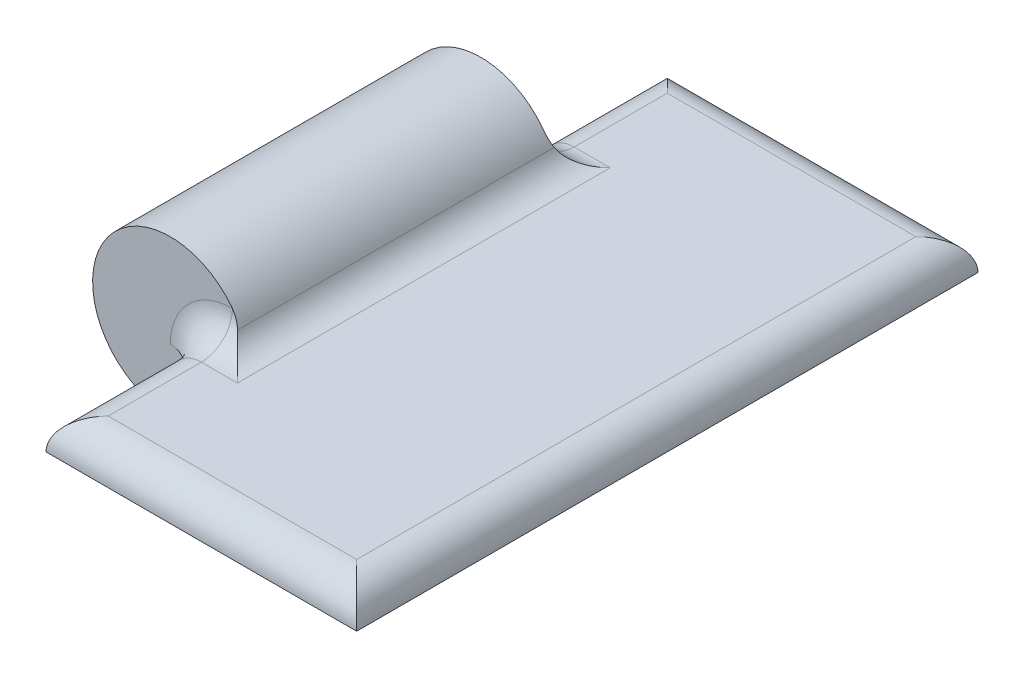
ISO-10303-21;
HEADER;
FILE_DESCRIPTION(('STEP AP214'),'2;1');
FILE_NAME('part.step','',(''),(''),'','','');
FILE_SCHEMA(('AUTOMOTIVE_DESIGN { 1 0 10303 214 1 1 1 1 }'));
ENDSEC;
DATA;
#1=APPLICATION_CONTEXT('core data for automotive mechanical design processes');
#2=APPLICATION_PROTOCOL_DEFINITION('international standard','automotive_design',2000,#1);
#3=PRODUCT_CONTEXT('',#1,'mechanical');
#4=PRODUCT('Part','Part','',(#3));
#5=PRODUCT_RELATED_PRODUCT_CATEGORY('part','',(#4));
#6=PRODUCT_DEFINITION_FORMATION('','',#4);
#7=PRODUCT_DEFINITION_CONTEXT('part definition',#1,'design');
#8=PRODUCT_DEFINITION('design','',#6,#7);
#9=PRODUCT_DEFINITION_SHAPE('','',#8);
#10=(LENGTH_UNIT() NAMED_UNIT(*) SI_UNIT(.MILLI.,.METRE.));
#11=(NAMED_UNIT(*) PLANE_ANGLE_UNIT() SI_UNIT($,.RADIAN.));
#12=(NAMED_UNIT(*) SI_UNIT($,.STERADIAN.) SOLID_ANGLE_UNIT());
#13=UNCERTAINTY_MEASURE_WITH_UNIT(LENGTH_MEASURE(1.E-05),#10,'distance_accuracy_value','');
#14=(GEOMETRIC_REPRESENTATION_CONTEXT(3) GLOBAL_UNCERTAINTY_ASSIGNED_CONTEXT((#13)) GLOBAL_UNIT_ASSIGNED_CONTEXT((#10,
#11,#12)) REPRESENTATION_CONTEXT('',''));
#15=CARTESIAN_POINT('',(0.,0.,0.));
#16=DIRECTION('',(0.,0.,1.));
#17=DIRECTION('',(1.,0.,0.));
#18=AXIS2_PLACEMENT_3D('',#15,#16,#17);
#19=CARTESIAN_POINT('',(0.,0.,20.));
#20=DIRECTION('',(0.,0.,1.));
#21=DIRECTION('',(1.,0.,0.));
#22=AXIS2_PLACEMENT_3D('',#19,#20,#21);
#23=PLANE('',#22);
#24=CARTESIAN_POINT('',(4.,-1.,20.));
#25=DIRECTION('',(0.,0.,1.));
#26=DIRECTION('',(1.,0.,0.));
#27=AXIS2_PLACEMENT_3D('',#24,#25,#26);
#28=CIRCLE('',#27,4.);
#29=CARTESIAN_POINT('',(4.,3.,20.));
#30=VERTEX_POINT('',#29);
#31=CARTESIAN_POINT('',(0.,-1.,20.));
#32=VERTEX_POINT('',#31);
#33=EDGE_CURVE('E193',#30,#32,#28,.T.);
#34=ORIENTED_EDGE('',*,*,#33,.F.);
#35=CARTESIAN_POINT('',(0.,0.,20.));
#36=DIRECTION('',(0.,0.,1.));
#37=DIRECTION('',(1.,0.,0.));
#38=AXIS2_PLACEMENT_3D('',#35,#36,#37);
#39=CIRCLE('',#38,5.);
#40=CARTESIAN_POINT('',(4.89897948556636,-1.,20.));
#41=VERTEX_POINT('',#40);
#42=EDGE_CURVE('E184',#30,#41,#39,.T.);
#43=ORIENTED_EDGE('',*,*,#42,.T.);
#44=DIRECTION('',(1.,0.,0.));
#45=VECTOR('',#44,1.);
#46=CARTESIAN_POINT('',(0.,-1.,20.));
#47=LINE('',#46,#45);
#48=EDGE_CURVE('E180',#32,#41,#47,.T.);
#49=ORIENTED_EDGE('',*,*,#48,.F.);
#50=EDGE_LOOP('',(#34,#43,#49));
#51=FACE_BOUND('',#50,.T.);
#52=ADVANCED_FACE('F33',(#51),#23,.T.);
#53=CARTESIAN_POINT('',(0.,1.,0.));
#54=DIRECTION('',(0.,-1.,0.));
#55=DIRECTION('',(0.,0.,-1.));
#56=AXIS2_PLACEMENT_3D('',#53,#54,#55);
#57=PLANE('',#56);
#58=DIRECTION('',(1.,0.,0.));
#59=VECTOR('',#58,1.);
#60=CARTESIAN_POINT('',(4.89897948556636,1.,-2.));
#61=LINE('',#60,#59);
#62=CARTESIAN_POINT('',(4.,1.,-2.));
#63=VERTEX_POINT('',#62);
#64=CARTESIAN_POINT('',(6.32455532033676,1.,-2.));
#65=VERTEX_POINT('',#64);
#66=EDGE_CURVE('E205',#63,#65,#61,.T.);
#67=ORIENTED_EDGE('',*,*,#66,.T.);
#68=DIRECTION('',(0.,0.,1.));
#69=VECTOR('',#68,1.);
#70=CARTESIAN_POINT('',(6.32455532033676,1.,20.));
#71=LINE('',#70,#69);
#72=CARTESIAN_POINT('',(6.32455532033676,1.,22.));
#73=VERTEX_POINT('',#72);
#74=EDGE_CURVE('E207',#65,#73,#71,.T.);
#75=ORIENTED_EDGE('',*,*,#74,.T.);
#76=DIRECTION('',(1.,0.,0.));
#77=VECTOR('',#76,1.);
#78=CARTESIAN_POINT('',(0.,1.,22.));
#79=LINE('',#78,#77);
#80=CARTESIAN_POINT('',(4.,1.,22.));
#81=VERTEX_POINT('',#80);
#82=EDGE_CURVE('E196',#73,#81,#79,.F.);
#83=ORIENTED_EDGE('',*,*,#82,.T.);
#84=DIRECTION('',(0.,0.,1.));
#85=VECTOR('',#84,1.);
#86=CARTESIAN_POINT('',(4.,1.,0.));
#87=LINE('',#86,#85);
#88=CARTESIAN_POINT('',(4.00000000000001,1.,28.));
#89=VERTEX_POINT('',#88);
#90=EDGE_CURVE('E171',#81,#89,#87,.T.);
#91=ORIENTED_EDGE('',*,*,#90,.T.);
#92=DIRECTION('',(1.,0.,0.));
#93=VECTOR('',#92,1.);
#94=CARTESIAN_POINT('',(0.,1.,28.));
#95=LINE('',#94,#93);
#96=CARTESIAN_POINT('',(20.,1.,28.));
#97=VERTEX_POINT('',#96);
#98=EDGE_CURVE('E167',#89,#97,#95,.T.);
#99=ORIENTED_EDGE('',*,*,#98,.T.);
#100=DIRECTION('',(0.,0.,-1.));
#101=VECTOR('',#100,1.);
#102=CARTESIAN_POINT('',(20.,1.,0.));
#103=LINE('',#102,#101);
#104=CARTESIAN_POINT('',(20.,1.,-8.));
#105=VERTEX_POINT('',#104);
#106=EDGE_CURVE('E200',#97,#105,#103,.T.);
#107=ORIENTED_EDGE('',*,*,#106,.T.);
#108=DIRECTION('',(-1.,0.,0.));
#109=VECTOR('',#108,1.);
#110=CARTESIAN_POINT('',(0.,1.,-8.));
#111=LINE('',#110,#109);
#112=CARTESIAN_POINT('',(4.,1.,-8.));
#113=VERTEX_POINT('',#112);
#114=EDGE_CURVE('E202',#105,#113,#111,.T.);
#115=ORIENTED_EDGE('',*,*,#114,.T.);
#116=DIRECTION('',(0.,0.,1.));
#117=VECTOR('',#116,1.);
#118=CARTESIAN_POINT('',(4.,1.,0.));
#119=LINE('',#118,#117);
#120=EDGE_CURVE('E138',#113,#63,#119,.T.);
#121=ORIENTED_EDGE('',*,*,#120,.T.);
#122=EDGE_LOOP('',(#67,#75,#83,#91,#99,#107,#115,#121));
#123=FACE_BOUND('',#122,.T.);
#124=ADVANCED_FACE('F257',(#123),#57,.F.);
#125=CARTESIAN_POINT('',(0.,-1.,0.));
#126=DIRECTION('',(0.,-1.,0.));
#127=DIRECTION('',(0.,0.,-1.));
#128=AXIS2_PLACEMENT_3D('',#125,#126,#127);
#129=PLANE('',#128);
#130=DIRECTION('',(0.,0.,1.));
#131=VECTOR('',#130,1.);
#132=CARTESIAN_POINT('',(2.,-1.,-10.));
#133=LINE('',#132,#131);
#134=CARTESIAN_POINT('',(2.,-1.,22.));
#135=VERTEX_POINT('',#134);
#136=CARTESIAN_POINT('',(2.00000000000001,-1.,30.));
#137=VERTEX_POINT('',#136);
#138=EDGE_CURVE('E125',#135,#137,#133,.T.);
#139=ORIENTED_EDGE('',*,*,#138,.F.);
#140=CARTESIAN_POINT('',(0.,-1.,22.));
#141=DIRECTION('',(0.,-1.,0.));
#142=DIRECTION('',(0.,0.,-1.));
#143=AXIS2_PLACEMENT_3D('',#140,#141,#142);
#144=CIRCLE('',#143,2.);
#145=EDGE_CURVE('E212',#135,#32,#144,.F.);
#146=ORIENTED_EDGE('',*,*,#145,.T.);
#147=ORIENTED_EDGE('',*,*,#48,.T.);
#148=DIRECTION('',(0.,0.,-1.));
#149=VECTOR('',#148,1.);
#150=CARTESIAN_POINT('',(4.89897948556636,-1.,20.));
#151=LINE('',#150,#149);
#152=CARTESIAN_POINT('',(4.89897948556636,-1.,0.));
#153=VERTEX_POINT('',#152);
#154=EDGE_CURVE('E177',#153,#41,#151,.F.);
#155=ORIENTED_EDGE('',*,*,#154,.F.);
#156=DIRECTION('',(1.,0.,0.));
#157=VECTOR('',#156,1.);
#158=CARTESIAN_POINT('',(0.,-1.,0.));
#159=LINE('',#158,#157);
#160=CARTESIAN_POINT('',(0.,-1.,0.));
#161=VERTEX_POINT('',#160);
#162=EDGE_CURVE('E186',#161,#153,#159,.T.);
#163=ORIENTED_EDGE('',*,*,#162,.F.);
#164=CARTESIAN_POINT('',(0.,-1.,-2.));
#165=DIRECTION('',(0.,-1.,0.));
#166=DIRECTION('',(0.,0.,-1.));
#167=AXIS2_PLACEMENT_3D('',#164,#165,#166);
#168=CIRCLE('',#167,2.);
#169=CARTESIAN_POINT('',(2.,-1.,-2.));
#170=VERTEX_POINT('',#169);
#171=EDGE_CURVE('E120',#161,#170,#168,.F.);
#172=ORIENTED_EDGE('',*,*,#171,.T.);
#173=CARTESIAN_POINT('',(2.,-1.,-10.));
#174=VERTEX_POINT('',#173);
#175=EDGE_CURVE('E114',#174,#170,#133,.T.);
#176=ORIENTED_EDGE('',*,*,#175,.F.);
#177=DIRECTION('',(-1.,0.,0.));
#178=VECTOR('',#177,1.);
#179=CARTESIAN_POINT('',(2.,-1.,-10.));
#180=LINE('',#179,#178);
#181=CARTESIAN_POINT('',(22.,-1.,-10.));
#182=VERTEX_POINT('',#181);
#183=EDGE_CURVE('E117',#182,#174,#180,.T.);
#184=ORIENTED_EDGE('',*,*,#183,.F.);
#185=DIRECTION('',(0.,0.,-1.));
#186=VECTOR('',#185,1.);
#187=CARTESIAN_POINT('',(22.,-1.,-10.));
#188=LINE('',#187,#186);
#189=CARTESIAN_POINT('',(22.,-1.,30.));
#190=VERTEX_POINT('',#189);
#191=EDGE_CURVE('E175',#190,#182,#188,.T.);
#192=ORIENTED_EDGE('',*,*,#191,.F.);
#193=DIRECTION('',(1.,0.,0.));
#194=VECTOR('',#193,1.);
#195=CARTESIAN_POINT('',(22.,-1.,30.));
#196=LINE('',#195,#194);
#197=EDGE_CURVE('E124',#137,#190,#196,.T.);
#198=ORIENTED_EDGE('',*,*,#197,.F.);
#199=EDGE_LOOP('',(#139,#146,#147,#155,#163,#172,#176,#184,#192,#198));
#200=FACE_BOUND('',#199,.T.);
#201=ADVANCED_FACE('F116',(#200),#129,.T.);
#202=CARTESIAN_POINT('',(0.,0.,20.));
#203=DIRECTION('',(0.,0.,-1.));
#204=DIRECTION('',(-1.,0.,0.));
#205=AXIS2_PLACEMENT_3D('',#202,#203,#204);
#206=CYLINDRICAL_SURFACE('',#205,5.);
#207=ORIENTED_EDGE('',*,*,#42,.F.);
#208=CARTESIAN_POINT('',(4.,3.,20.));
#209=CARTESIAN_POINT('',(4.03891743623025,2.94812707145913,19.9999959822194));
#210=CARTESIAN_POINT('',(4.07682528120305,2.89546419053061,20.0020185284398));
#211=CARTESIAN_POINT('',(4.15046835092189,2.78886861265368,20.0104566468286));
#212=CARTESIAN_POINT('',(4.1862001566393,2.73493409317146,20.0168789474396));
#213=CARTESIAN_POINT('',(4.25453941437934,2.6273337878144,20.0342859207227));
#214=CARTESIAN_POINT('',(4.28719444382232,2.57368352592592,20.0451785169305));
#215=CARTESIAN_POINT('',(4.34994700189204,2.46613667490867,20.0717743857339));
#216=CARTESIAN_POINT('',(4.38004693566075,2.41224036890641,20.0874730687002));
#217=CARTESIAN_POINT('',(4.42809748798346,2.322418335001,20.1178912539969));
#218=CARTESIAN_POINT('',(4.4467864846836,2.28641567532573,20.1312328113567));
#219=CARTESIAN_POINT('',(4.4830488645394,2.21447765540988,20.160306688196));
#220=CARTESIAN_POINT('',(4.50061401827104,2.17854432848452,20.1760542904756));
#221=CARTESIAN_POINT('',(4.51753951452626,2.14285714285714,20.1929841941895));
#222=B_SPLINE_CURVE_WITH_KNOTS('',3,(#208,#209,#210,#211,#212,#213,#214,#215,#216,#217,#218,
#219,#220,#221),.UNSPECIFIED.,.F.,.F.,(4,2,2,2,2,2,4),(0.,0.194542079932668,0.389382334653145,
0.580396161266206,0.771228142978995,0.899258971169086,1.02813971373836),.UNSPECIFIED.);
#223=CARTESIAN_POINT('',(4.51753951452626,2.14285714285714,20.1929841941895));
#224=VERTEX_POINT('',#223);
#225=EDGE_CURVE('E11',#30,#224,#222,.T.);
#226=ORIENTED_EDGE('',*,*,#225,.T.);
#227=DIRECTION('',(0.,0.,-1.));
#228=VECTOR('',#227,1.);
#229=CARTESIAN_POINT('',(4.51753951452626,2.14285714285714,20.));
#230=LINE('',#229,#228);
#231=CARTESIAN_POINT('',(4.51753951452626,2.14285714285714,-0.192984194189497));
#232=VERTEX_POINT('',#231);
#233=EDGE_CURVE('E49',#224,#232,#230,.T.);
#234=ORIENTED_EDGE('',*,*,#233,.T.);
#235=CARTESIAN_POINT('',(4.51753951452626,2.14285714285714,-0.192984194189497));
#236=CARTESIAN_POINT('',(4.49198767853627,2.19675767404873,-0.167404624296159));
#237=CARTESIAN_POINT('',(4.46496024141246,2.25121494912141,-0.144538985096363));
#238=CARTESIAN_POINT('',(4.40810803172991,2.36058073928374,-0.104076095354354));
#239=CARTESIAN_POINT('',(4.37828503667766,2.41548894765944,-0.0864755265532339));
#240=CARTESIAN_POINT('',(4.31651293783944,2.52419616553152,-0.0566172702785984));
#241=CARTESIAN_POINT('',(4.28461064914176,2.57799764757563,-0.0442707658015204));
#242=CARTESIAN_POINT('',(4.21840392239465,2.68496189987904,-0.0242191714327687));
#243=CARTESIAN_POINT('',(4.18410009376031,2.73812482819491,-0.0165129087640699));
#244=CARTESIAN_POINT('',(4.12494407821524,2.82606596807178,-0.00726111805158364));
#245=CARTESIAN_POINT('',(4.10069826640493,2.86113469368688,-0.00452260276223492));
#246=CARTESIAN_POINT('',(4.05112048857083,2.93091598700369,-0.000886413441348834));
#247=CARTESIAN_POINT('',(4.02578281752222,2.96562509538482,-2.70080353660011E-08));
#248=CARTESIAN_POINT('',(4.,3.,0.));
#249=B_SPLINE_CURVE_WITH_KNOTS('',3,(#235,#236,#237,#238,#239,#240,#241,#242,#243,#244,#245,
#246,#247,#248),.UNSPECIFIED.,.F.,.F.,(4,2,2,2,2,2,4),(0.,0.194598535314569,0.389074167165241,
0.580117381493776,0.771112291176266,0.899227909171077,1.02812206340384),.UNSPECIFIED.);
#250=CARTESIAN_POINT('',(4.,3.,0.));
#251=VERTEX_POINT('',#250);
#252=EDGE_CURVE('E42',#232,#251,#249,.T.);
#253=ORIENTED_EDGE('',*,*,#252,.T.);
#254=CARTESIAN_POINT('',(0.,0.,0.));
#255=DIRECTION('',(0.,0.,1.));
#256=DIRECTION('',(1.,0.,0.));
#257=AXIS2_PLACEMENT_3D('',#254,#255,#256);
#258=CIRCLE('',#257,5.);
#259=EDGE_CURVE('E183',#251,#153,#258,.T.);
#260=ORIENTED_EDGE('',*,*,#259,.T.);
#261=ORIENTED_EDGE('',*,*,#154,.T.);
#262=EDGE_LOOP('',(#207,#226,#234,#253,#260,#261));
#263=FACE_BOUND('',#262,.T.);
#264=ADVANCED_FACE('F224',(#263),#206,.T.);
#265=CARTESIAN_POINT('',(0.,0.,0.));
#266=DIRECTION('',(0.,0.,1.));
#267=DIRECTION('',(1.,0.,0.));
#268=AXIS2_PLACEMENT_3D('',#265,#266,#267);
#269=PLANE('',#268);
#270=CARTESIAN_POINT('',(4.,-1.,0.));
#271=DIRECTION('',(0.,0.,1.));
#272=DIRECTION('',(1.,0.,0.));
#273=AXIS2_PLACEMENT_3D('',#270,#271,#272);
#274=CIRCLE('',#273,4.);
#275=EDGE_CURVE('E190',#161,#251,#274,.F.);
#276=ORIENTED_EDGE('',*,*,#275,.F.);
#277=ORIENTED_EDGE('',*,*,#162,.T.);
#278=ORIENTED_EDGE('',*,*,#259,.F.);
#279=EDGE_LOOP('',(#276,#277,#278));
#280=FACE_BOUND('',#279,.T.);
#281=ADVANCED_FACE('F255',(#280),#269,.F.);
#282=CARTESIAN_POINT('',(4.,-1.,0.));
#283=DIRECTION('',(0.,0.,1.));
#284=DIRECTION('',(1.,0.,0.));
#285=AXIS2_PLACEMENT_3D('',#282,#283,#284);
#286=CYLINDRICAL_SURFACE('',#285,2.);
#287=CARTESIAN_POINT('',(4.,-1.,22.));
#288=DIRECTION('',(0.,0.,1.));
#289=DIRECTION('',(1.,0.,0.));
#290=AXIS2_PLACEMENT_3D('',#287,#288,#289);
#291=CIRCLE('',#290,2.);
#292=EDGE_CURVE('E154',#135,#81,#291,.F.);
#293=ORIENTED_EDGE('',*,*,#292,.F.);
#294=ORIENTED_EDGE('',*,*,#138,.T.);
#295=CARTESIAN_POINT('',(4.00000000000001,-1.,28.));
#296=DIRECTION('',(0.707106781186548,0.,0.707106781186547));
#297=DIRECTION('',(-0.707106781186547,0.,0.707106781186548));
#298=AXIS2_PLACEMENT_3D('',#295,#296,#297);
#299=ELLIPSE('',#298,2.82842712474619,2.);
#300=EDGE_CURVE('E37',#89,#137,#299,.T.);
#301=ORIENTED_EDGE('',*,*,#300,.F.);
#302=ORIENTED_EDGE('',*,*,#90,.F.);
#303=EDGE_LOOP('',(#293,#294,#301,#302));
#304=FACE_BOUND('',#303,.T.);
#305=ADVANCED_FACE('F35',(#304),#286,.T.);
#306=CARTESIAN_POINT('',(0.,-1.,28.));
#307=DIRECTION('',(1.,0.,0.));
#308=DIRECTION('',(0.,0.,-1.));
#309=AXIS2_PLACEMENT_3D('',#306,#307,#308);
#310=CYLINDRICAL_SURFACE('',#309,2.);
#311=ORIENTED_EDGE('',*,*,#300,.T.);
#312=ORIENTED_EDGE('',*,*,#197,.T.);
#313=CARTESIAN_POINT('',(20.,-1.,28.));
#314=DIRECTION('',(0.707106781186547,0.,-0.707106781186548));
#315=DIRECTION('',(0.707106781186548,0.,0.707106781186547));
#316=AXIS2_PLACEMENT_3D('',#313,#314,#315);
#317=ELLIPSE('',#316,2.82842712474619,2.);
#318=EDGE_CURVE('E152',#97,#190,#317,.T.);
#319=ORIENTED_EDGE('',*,*,#318,.F.);
#320=ORIENTED_EDGE('',*,*,#98,.F.);
#321=EDGE_LOOP('',(#311,#312,#319,#320));
#322=FACE_BOUND('',#321,.T.);
#323=ADVANCED_FACE('F165',(#322),#310,.T.);
#324=CARTESIAN_POINT('',(4.,-1.,22.));
#325=DIRECTION('',(0.,0.,1.));
#326=DIRECTION('',(1.,0.,0.));
#327=AXIS2_PLACEMENT_3D('',#324,#325,#326);
#328=TOROIDAL_SURFACE('',#327,4.,2.);
#329=ORIENTED_EDGE('',*,*,#145,.F.);
#330=ORIENTED_EDGE('',*,*,#292,.T.);
#331=CARTESIAN_POINT('',(4.,3.,22.));
#332=DIRECTION('',(1.,0.,0.));
#333=DIRECTION('',(0.,0.,-1.));
#334=AXIS2_PLACEMENT_3D('',#331,#332,#333);
#335=CIRCLE('',#334,2.);
#336=EDGE_CURVE('E149',#30,#81,#335,.F.);
#337=ORIENTED_EDGE('',*,*,#336,.F.);
#338=ORIENTED_EDGE('',*,*,#33,.T.);
#339=EDGE_LOOP('',(#329,#330,#337,#338));
#340=FACE_BOUND('',#339,.T.);
#341=ADVANCED_FACE('F248',(#340),#328,.F.);
#342=CARTESIAN_POINT('',(20.,-1.,0.));
#343=DIRECTION('',(0.,0.,-1.));
#344=DIRECTION('',(-1.,0.,0.));
#345=AXIS2_PLACEMENT_3D('',#342,#343,#344);
#346=CYLINDRICAL_SURFACE('',#345,2.);
#347=ORIENTED_EDGE('',*,*,#318,.T.);
#348=ORIENTED_EDGE('',*,*,#191,.T.);
#349=CARTESIAN_POINT('',(20.,-1.,-8.));
#350=DIRECTION('',(-0.707106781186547,0.,-0.707106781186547));
#351=DIRECTION('',(0.707106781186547,0.,-0.707106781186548));
#352=AXIS2_PLACEMENT_3D('',#349,#350,#351);
#353=ELLIPSE('',#352,2.82842712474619,2.);
#354=EDGE_CURVE('E135',#105,#182,#353,.T.);
#355=ORIENTED_EDGE('',*,*,#354,.F.);
#356=ORIENTED_EDGE('',*,*,#106,.F.);
#357=EDGE_LOOP('',(#347,#348,#355,#356));
#358=FACE_BOUND('',#357,.T.);
#359=ADVANCED_FACE('F244',(#358),#346,.T.);
#360=CARTESIAN_POINT('',(0.,3.,22.));
#361=DIRECTION('',(1.,0.,0.));
#362=DIRECTION('',(0.,0.,-1.));
#363=AXIS2_PLACEMENT_3D('',#360,#361,#362);
#364=CYLINDRICAL_SURFACE('',#363,2.);
#365=ORIENTED_EDGE('',*,*,#336,.T.);
#366=ORIENTED_EDGE('',*,*,#82,.F.);
#367=CARTESIAN_POINT('',(6.32455532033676,3.,22.));
#368=DIRECTION('',(0.707106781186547,0.,-0.707106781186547));
#369=DIRECTION('',(0.707106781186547,0.,0.707106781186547));
#370=AXIS2_PLACEMENT_3D('',#367,#368,#369);
#371=ELLIPSE('',#370,2.82842712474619,2.);
#372=EDGE_CURVE('E139',#224,#73,#371,.F.);
#373=ORIENTED_EDGE('',*,*,#372,.F.);
#374=ORIENTED_EDGE('',*,*,#225,.F.);
#375=EDGE_LOOP('',(#365,#366,#373,#374));
#376=FACE_BOUND('',#375,.T.);
#377=ADVANCED_FACE('F240',(#376),#364,.F.);
#378=CARTESIAN_POINT('',(0.,-1.,-8.));
#379=DIRECTION('',(-1.,0.,0.));
#380=DIRECTION('',(0.,0.,1.));
#381=AXIS2_PLACEMENT_3D('',#378,#379,#380);
#382=CYLINDRICAL_SURFACE('',#381,2.);
#383=ORIENTED_EDGE('',*,*,#354,.T.);
#384=ORIENTED_EDGE('',*,*,#183,.T.);
#385=CARTESIAN_POINT('',(4.,-1.,-8.));
#386=DIRECTION('',(-0.707106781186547,0.,0.707106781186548));
#387=DIRECTION('',(-0.707106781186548,0.,-0.707106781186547));
#388=AXIS2_PLACEMENT_3D('',#385,#386,#387);
#389=ELLIPSE('',#388,2.82842712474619,2.);
#390=EDGE_CURVE('E132',#113,#174,#389,.T.);
#391=ORIENTED_EDGE('',*,*,#390,.F.);
#392=ORIENTED_EDGE('',*,*,#114,.F.);
#393=EDGE_LOOP('',(#383,#384,#391,#392));
#394=FACE_BOUND('',#393,.T.);
#395=ADVANCED_FACE('F130',(#394),#382,.T.);
#396=CARTESIAN_POINT('',(6.32455532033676,3.,20.));
#397=DIRECTION('',(0.,0.,-1.));
#398=DIRECTION('',(-1.,0.,0.));
#399=AXIS2_PLACEMENT_3D('',#396,#397,#398);
#400=CYLINDRICAL_SURFACE('',#399,2.);
#401=ORIENTED_EDGE('',*,*,#372,.T.);
#402=ORIENTED_EDGE('',*,*,#74,.F.);
#403=CARTESIAN_POINT('',(6.32455532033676,3.,-2.));
#404=DIRECTION('',(-0.707106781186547,0.,-0.707106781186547));
#405=DIRECTION('',(-0.707106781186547,0.,0.707106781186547));
#406=AXIS2_PLACEMENT_3D('',#403,#404,#405);
#407=ELLIPSE('',#406,2.82842712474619,2.);
#408=EDGE_CURVE('E140',#232,#65,#407,.F.);
#409=ORIENTED_EDGE('',*,*,#408,.F.);
#410=ORIENTED_EDGE('',*,*,#233,.F.);
#411=EDGE_LOOP('',(#401,#402,#409,#410));
#412=FACE_BOUND('',#411,.T.);
#413=ADVANCED_FACE('F236',(#412),#400,.F.);
#414=CARTESIAN_POINT('',(4.,-1.,0.));
#415=DIRECTION('',(0.,0.,1.));
#416=DIRECTION('',(1.,0.,0.));
#417=AXIS2_PLACEMENT_3D('',#414,#415,#416);
#418=CYLINDRICAL_SURFACE('',#417,2.);
#419=ORIENTED_EDGE('',*,*,#390,.T.);
#420=ORIENTED_EDGE('',*,*,#175,.T.);
#421=CARTESIAN_POINT('',(4.,-1.,-2.));
#422=DIRECTION('',(0.,0.,1.));
#423=DIRECTION('',(1.,0.,0.));
#424=AXIS2_PLACEMENT_3D('',#421,#422,#423);
#425=CIRCLE('',#424,2.);
#426=EDGE_CURVE('E144',#63,#170,#425,.T.);
#427=ORIENTED_EDGE('',*,*,#426,.F.);
#428=ORIENTED_EDGE('',*,*,#120,.F.);
#429=EDGE_LOOP('',(#419,#420,#427,#428));
#430=FACE_BOUND('',#429,.T.);
#431=ADVANCED_FACE('F137',(#430),#418,.T.);
#432=CARTESIAN_POINT('',(0.,3.,-2.));
#433=DIRECTION('',(-1.,0.,0.));
#434=DIRECTION('',(0.,0.,1.));
#435=AXIS2_PLACEMENT_3D('',#432,#433,#434);
#436=CYLINDRICAL_SURFACE('',#435,2.);
#437=ORIENTED_EDGE('',*,*,#408,.T.);
#438=ORIENTED_EDGE('',*,*,#66,.F.);
#439=CARTESIAN_POINT('',(4.,3.,-2.));
#440=DIRECTION('',(1.,0.,0.));
#441=DIRECTION('',(0.,0.,-1.));
#442=AXIS2_PLACEMENT_3D('',#439,#440,#441);
#443=CIRCLE('',#442,2.);
#444=EDGE_CURVE('E277',#251,#63,#443,.T.);
#445=ORIENTED_EDGE('',*,*,#444,.F.);
#446=ORIENTED_EDGE('',*,*,#252,.F.);
#447=EDGE_LOOP('',(#437,#438,#445,#446));
#448=FACE_BOUND('',#447,.T.);
#449=ADVANCED_FACE('F228',(#448),#436,.F.);
#450=CARTESIAN_POINT('',(4.,-1.,-2.));
#451=DIRECTION('',(0.,0.,1.));
#452=DIRECTION('',(1.,0.,0.));
#453=AXIS2_PLACEMENT_3D('',#450,#451,#452);
#454=TOROIDAL_SURFACE('',#453,4.,2.);
#455=ORIENTED_EDGE('',*,*,#444,.T.);
#456=ORIENTED_EDGE('',*,*,#426,.T.);
#457=ORIENTED_EDGE('',*,*,#171,.F.);
#458=ORIENTED_EDGE('',*,*,#275,.T.);
#459=EDGE_LOOP('',(#455,#456,#457,#458));
#460=FACE_BOUND('',#459,.T.);
#461=ADVANCED_FACE('F232',(#460),#454,.F.);
#462=CLOSED_SHELL('',(#52,#124,#201,#264,#281,#305,#323,#341,#359,#377,#395,#413,#431,#449,#461));
#463=MANIFOLD_SOLID_BREP('B2',#462);
#464=ADVANCED_BREP_SHAPE_REPRESENTATION('',(#18,#463),#14);
#465=SHAPE_DEFINITION_REPRESENTATION(#9,#464);
ENDSEC;
END-ISO-10303-21;
